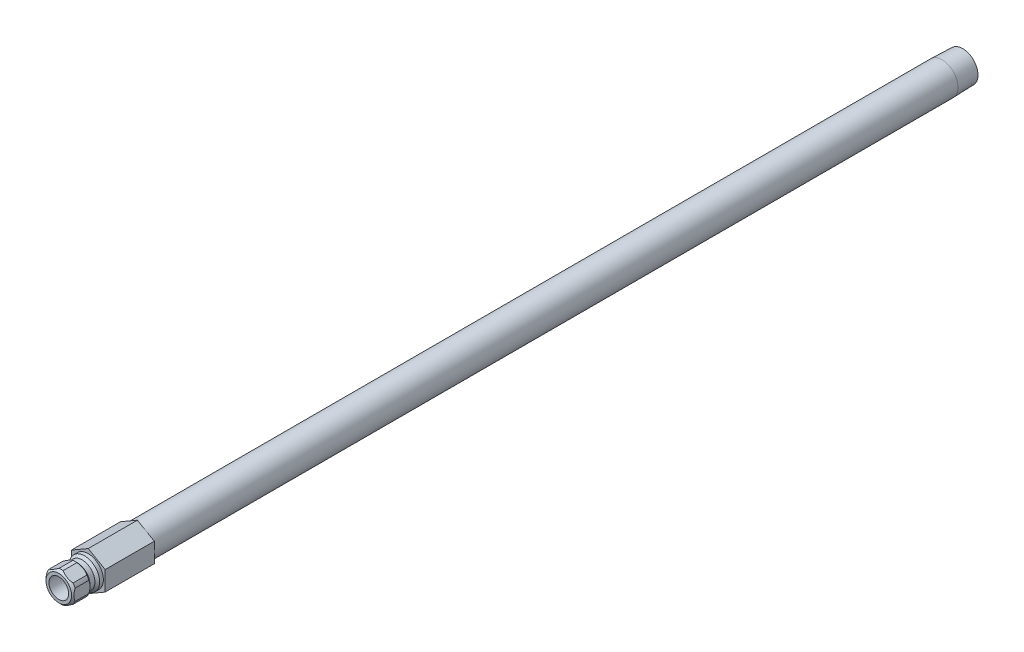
ISO-10303-21;
HEADER;
FILE_DESCRIPTION(('STEP AP214'),'2;1');
FILE_NAME('part.step','',(''),(''),'','','');
FILE_SCHEMA(('AUTOMOTIVE_DESIGN { 1 0 10303 214 1 1 1 1 }'));
ENDSEC;
DATA;
#1=APPLICATION_CONTEXT('core data for automotive mechanical design processes');
#2=APPLICATION_PROTOCOL_DEFINITION('international standard','automotive_design',2000,#1);
#3=PRODUCT_CONTEXT('',#1,'mechanical');
#4=PRODUCT('Part','Part','',(#3));
#5=PRODUCT_RELATED_PRODUCT_CATEGORY('part','',(#4));
#6=PRODUCT_DEFINITION_FORMATION('','',#4);
#7=PRODUCT_DEFINITION_CONTEXT('part definition',#1,'design');
#8=PRODUCT_DEFINITION('design','',#6,#7);
#9=PRODUCT_DEFINITION_SHAPE('','',#8);
#10=(LENGTH_UNIT() NAMED_UNIT(*) SI_UNIT(.MILLI.,.METRE.));
#11=(NAMED_UNIT(*) PLANE_ANGLE_UNIT() SI_UNIT($,.RADIAN.));
#12=(NAMED_UNIT(*) SI_UNIT($,.STERADIAN.) SOLID_ANGLE_UNIT());
#13=UNCERTAINTY_MEASURE_WITH_UNIT(LENGTH_MEASURE(1.E-05),#10,'distance_accuracy_value','');
#14=(GEOMETRIC_REPRESENTATION_CONTEXT(3) GLOBAL_UNCERTAINTY_ASSIGNED_CONTEXT((#13)) GLOBAL_UNIT_ASSIGNED_CONTEXT((#10,
#11,#12)) REPRESENTATION_CONTEXT('',''));
#15=CARTESIAN_POINT('',(0.,0.,0.));
#16=DIRECTION('',(0.,0.,1.));
#17=DIRECTION('',(1.,0.,0.));
#18=AXIS2_PLACEMENT_3D('',#15,#16,#17);
#19=CARTESIAN_POINT('',(0.,0.,0.));
#20=DIRECTION('',(0.,0.,-1.));
#21=DIRECTION('',(0.,1.,0.));
#22=AXIS2_PLACEMENT_3D('',#19,#20,#21);
#23=CYLINDRICAL_SURFACE('',#22,4.8895);
#24=DIRECTION('',(0.,0.,-1.));
#25=VECTOR('',#24,1.);
#26=CARTESIAN_POINT('',(-4.5212,-1.86170910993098,0.));
#27=LINE('',#26,#25);
#28=CARTESIAN_POINT('',(-4.5212,-1.86170910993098,4.318));
#29=VERTEX_POINT('',#28);
#30=CARTESIAN_POINT('',(-4.5212,-1.86170910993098,8.763));
#31=VERTEX_POINT('',#30);
#32=EDGE_CURVE('E61',#29,#31,#27,.F.);
#33=ORIENTED_EDGE('',*,*,#32,.F.);
#34=CARTESIAN_POINT('',(0.,0.,4.318));
#35=DIRECTION('',(0.,0.,-1.));
#36=DIRECTION('',(0.,1.,0.));
#37=AXIS2_PLACEMENT_3D('',#34,#35,#36);
#38=CIRCLE('',#37,4.8895);
#39=CARTESIAN_POINT('',(-3.87288738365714,-2.98461950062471,4.318));
#40=VERTEX_POINT('',#39);
#41=EDGE_CURVE('E650',#40,#29,#38,.T.);
#42=ORIENTED_EDGE('',*,*,#41,.F.);
#43=DIRECTION('',(0.,0.,-1.));
#44=VECTOR('',#43,1.);
#45=CARTESIAN_POINT('',(-3.87288738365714,-2.98461950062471,0.));
#46=LINE('',#45,#44);
#47=CARTESIAN_POINT('',(-3.87288738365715,-2.98461950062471,8.763));
#48=VERTEX_POINT('',#47);
#49=EDGE_CURVE('E218',#48,#40,#46,.T.);
#50=ORIENTED_EDGE('',*,*,#49,.F.);
#51=CARTESIAN_POINT('',(0.,0.,8.763));
#52=DIRECTION('',(0.,0.,-1.));
#53=DIRECTION('',(0.,1.,0.));
#54=AXIS2_PLACEMENT_3D('',#51,#52,#53);
#55=CIRCLE('',#54,4.8895);
#56=EDGE_CURVE('E189',#48,#31,#55,.T.);
#57=ORIENTED_EDGE('',*,*,#56,.T.);
#58=EDGE_LOOP('',(#33,#42,#50,#57));
#59=FACE_BOUND('',#58,.T.);
#60=ADVANCED_FACE('F34',(#59),#23,.T.);
#61=DIRECTION('',(0.,0.,-1.));
#62=VECTOR('',#61,1.);
#63=CARTESIAN_POINT('',(-0.648312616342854,-4.84632861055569,0.));
#64=LINE('',#63,#62);
#65=CARTESIAN_POINT('',(-0.648312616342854,-4.84632861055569,4.318));
#66=VERTEX_POINT('',#65);
#67=CARTESIAN_POINT('',(-0.648312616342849,-4.84632861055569,8.763));
#68=VERTEX_POINT('',#67);
#69=EDGE_CURVE('E232',#66,#68,#64,.F.);
#70=ORIENTED_EDGE('',*,*,#69,.F.);
#71=CARTESIAN_POINT('',(0.648312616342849,-4.84632861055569,4.318));
#72=VERTEX_POINT('',#71);
#73=EDGE_CURVE('E388',#72,#66,#38,.T.);
#74=ORIENTED_EDGE('',*,*,#73,.F.);
#75=DIRECTION('',(0.,0.,-1.));
#76=VECTOR('',#75,1.);
#77=CARTESIAN_POINT('',(0.648312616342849,-4.84632861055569,0.));
#78=LINE('',#77,#76);
#79=CARTESIAN_POINT('',(0.648312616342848,-4.84632861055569,8.763));
#80=VERTEX_POINT('',#79);
#81=EDGE_CURVE('E654',#80,#72,#78,.T.);
#82=ORIENTED_EDGE('',*,*,#81,.F.);
#83=EDGE_CURVE('E202',#80,#68,#55,.T.);
#84=ORIENTED_EDGE('',*,*,#83,.T.);
#85=EDGE_LOOP('',(#70,#74,#82,#84));
#86=FACE_BOUND('',#85,.T.);
#87=ADVANCED_FACE('F351',(#86),#23,.T.);
#88=DIRECTION('',(0.,0.,-1.));
#89=VECTOR('',#88,1.);
#90=CARTESIAN_POINT('',(3.87288738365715,-2.98461950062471,0.));
#91=LINE('',#90,#89);
#92=CARTESIAN_POINT('',(3.87288738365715,-2.98461950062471,4.318));
#93=VERTEX_POINT('',#92);
#94=CARTESIAN_POINT('',(3.87288738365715,-2.98461950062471,8.763));
#95=VERTEX_POINT('',#94);
#96=EDGE_CURVE('E294',#93,#95,#91,.F.);
#97=ORIENTED_EDGE('',*,*,#96,.F.);
#98=CARTESIAN_POINT('',(4.5212,-1.86170910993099,4.318));
#99=VERTEX_POINT('',#98);
#100=EDGE_CURVE('E384',#99,#93,#38,.T.);
#101=ORIENTED_EDGE('',*,*,#100,.F.);
#102=DIRECTION('',(0.,0.,-1.));
#103=VECTOR('',#102,1.);
#104=CARTESIAN_POINT('',(4.5212,-1.86170910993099,0.));
#105=LINE('',#104,#103);
#106=CARTESIAN_POINT('',(4.5212,-1.86170910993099,8.763));
#107=VERTEX_POINT('',#106);
#108=EDGE_CURVE('E377',#107,#99,#105,.T.);
#109=ORIENTED_EDGE('',*,*,#108,.F.);
#110=EDGE_CURVE('E195',#107,#95,#55,.T.);
#111=ORIENTED_EDGE('',*,*,#110,.T.);
#112=EDGE_LOOP('',(#97,#101,#109,#111));
#113=FACE_BOUND('',#112,.T.);
#114=ADVANCED_FACE('F355',(#113),#23,.T.);
#115=DIRECTION('',(0.,0.,-1.));
#116=VECTOR('',#115,1.);
#117=CARTESIAN_POINT('',(4.5212,1.86170910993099,0.));
#118=LINE('',#117,#116);
#119=CARTESIAN_POINT('',(4.5212,1.86170910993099,4.318));
#120=VERTEX_POINT('',#119);
#121=CARTESIAN_POINT('',(4.5212,1.86170910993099,8.763));
#122=VERTEX_POINT('',#121);
#123=EDGE_CURVE('E373',#120,#122,#118,.F.);
#124=ORIENTED_EDGE('',*,*,#123,.F.);
#125=CARTESIAN_POINT('',(3.87288738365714,2.98461950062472,4.318));
#126=VERTEX_POINT('',#125);
#127=EDGE_CURVE('E200',#126,#120,#38,.T.);
#128=ORIENTED_EDGE('',*,*,#127,.F.);
#129=DIRECTION('',(0.,0.,-1.));
#130=VECTOR('',#129,1.);
#131=CARTESIAN_POINT('',(3.87288738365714,2.98461950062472,0.));
#132=LINE('',#131,#130);
#133=CARTESIAN_POINT('',(3.87288738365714,2.98461950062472,8.763));
#134=VERTEX_POINT('',#133);
#135=EDGE_CURVE('E651',#134,#126,#132,.T.);
#136=ORIENTED_EDGE('',*,*,#135,.F.);
#137=EDGE_CURVE('E188',#134,#122,#55,.T.);
#138=ORIENTED_EDGE('',*,*,#137,.T.);
#139=EDGE_LOOP('',(#124,#128,#136,#138));
#140=FACE_BOUND('',#139,.T.);
#141=ADVANCED_FACE('F361',(#140),#23,.T.);
#142=DIRECTION('',(0.,0.,-1.));
#143=VECTOR('',#142,1.);
#144=CARTESIAN_POINT('',(0.648312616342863,4.84632861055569,0.));
#145=LINE('',#144,#143);
#146=CARTESIAN_POINT('',(0.648312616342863,4.84632861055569,4.318));
#147=VERTEX_POINT('',#146);
#148=CARTESIAN_POINT('',(0.648312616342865,4.84632861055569,8.763));
#149=VERTEX_POINT('',#148);
#150=EDGE_CURVE('E652',#147,#149,#145,.F.);
#151=ORIENTED_EDGE('',*,*,#150,.F.);
#152=CARTESIAN_POINT('',(-0.648312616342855,4.84632861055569,4.318));
#153=VERTEX_POINT('',#152);
#154=EDGE_CURVE('E179',#153,#147,#38,.T.);
#155=ORIENTED_EDGE('',*,*,#154,.F.);
#156=DIRECTION('',(0.,0.,-1.));
#157=VECTOR('',#156,1.);
#158=CARTESIAN_POINT('',(-0.648312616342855,4.84632861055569,0.));
#159=LINE('',#158,#157);
#160=CARTESIAN_POINT('',(-0.648312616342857,4.84632861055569,8.763));
#161=VERTEX_POINT('',#160);
#162=EDGE_CURVE('E163',#161,#153,#159,.T.);
#163=ORIENTED_EDGE('',*,*,#162,.F.);
#164=EDGE_CURVE('E177',#161,#149,#55,.T.);
#165=ORIENTED_EDGE('',*,*,#164,.T.);
#166=EDGE_LOOP('',(#151,#155,#163,#165));
#167=FACE_BOUND('',#166,.T.);
#168=ADVANCED_FACE('F176',(#167),#23,.T.);
#169=CARTESIAN_POINT('',(0.,4.8895,0.));
#170=DIRECTION('',(0.,0.,1.));
#171=DIRECTION('',(0.,-1.,0.));
#172=AXIS2_PLACEMENT_3D('',#169,#170,#171);
#173=PLANE('',#172);
#174=CARTESIAN_POINT('',(0.,0.,0.));
#175=DIRECTION('',(0.,0.,-1.));
#176=DIRECTION('',(0.,1.,0.));
#177=AXIS2_PLACEMENT_3D('',#174,#175,#176);
#178=CIRCLE('',#177,4.8895);
#179=CARTESIAN_POINT('',(0.,4.8895,0.));
#180=VERTEX_POINT('',#179);
#181=EDGE_CURVE('E395',#180,#180,#178,.T.);
#182=ORIENTED_EDGE('',*,*,#181,.T.);
#183=EDGE_LOOP('',(#182));
#184=FACE_BOUND('',#183,.T.);
#185=DIRECTION('',(-0.866025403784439,-0.5,0.));
#186=VECTOR('',#185,1.);
#187=CARTESIAN_POINT('',(0.,6.3058196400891,0.));
#188=LINE('',#187,#186);
#189=CARTESIAN_POINT('',(0.,6.3058196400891,0.));
#190=VERTEX_POINT('',#189);
#191=CARTESIAN_POINT('',(-5.461,3.15290982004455,0.));
#192=VERTEX_POINT('',#191);
#193=EDGE_CURVE('E445',#190,#192,#188,.T.);
#194=ORIENTED_EDGE('',*,*,#193,.T.);
#195=DIRECTION('',(0.,-1.,0.));
#196=VECTOR('',#195,1.);
#197=CARTESIAN_POINT('',(-5.461,3.15290982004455,0.));
#198=LINE('',#197,#196);
#199=CARTESIAN_POINT('',(-5.461,-3.15290982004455,0.));
#200=VERTEX_POINT('',#199);
#201=EDGE_CURVE('E448',#192,#200,#198,.T.);
#202=ORIENTED_EDGE('',*,*,#201,.T.);
#203=DIRECTION('',(0.866025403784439,-0.5,0.));
#204=VECTOR('',#203,1.);
#205=CARTESIAN_POINT('',(-5.461,-3.15290982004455,0.));
#206=LINE('',#205,#204);
#207=CARTESIAN_POINT('',(0.,-6.30581964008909,0.));
#208=VERTEX_POINT('',#207);
#209=EDGE_CURVE('E451',#200,#208,#206,.T.);
#210=ORIENTED_EDGE('',*,*,#209,.T.);
#211=DIRECTION('',(0.866025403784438,0.5,0.));
#212=VECTOR('',#211,1.);
#213=CARTESIAN_POINT('',(0.,-6.30581964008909,0.));
#214=LINE('',#213,#212);
#215=CARTESIAN_POINT('',(5.461,-3.15290982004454,0.));
#216=VERTEX_POINT('',#215);
#217=EDGE_CURVE('E454',#208,#216,#214,.T.);
#218=ORIENTED_EDGE('',*,*,#217,.T.);
#219=DIRECTION('',(0.,1.,0.));
#220=VECTOR('',#219,1.);
#221=CARTESIAN_POINT('',(5.461,-3.15290982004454,0.));
#222=LINE('',#221,#220);
#223=CARTESIAN_POINT('',(5.461,3.15290982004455,0.));
#224=VERTEX_POINT('',#223);
#225=EDGE_CURVE('E456',#216,#224,#222,.T.);
#226=ORIENTED_EDGE('',*,*,#225,.T.);
#227=DIRECTION('',(-0.866025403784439,0.5,0.));
#228=VECTOR('',#227,1.);
#229=CARTESIAN_POINT('',(5.461,3.15290982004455,0.));
#230=LINE('',#229,#228);
#231=EDGE_CURVE('E424',#224,#190,#230,.T.);
#232=ORIENTED_EDGE('',*,*,#231,.T.);
#233=EDGE_LOOP('',(#194,#202,#210,#218,#226,#232));
#234=FACE_BOUND('',#233,.T.);
#235=ADVANCED_FACE('F360',(#184,#234),#173,.T.);
#236=CARTESIAN_POINT('',(0.,0.,0.));
#237=DIRECTION('',(0.,0.,-1.));
#238=DIRECTION('',(0.,1.,0.));
#239=AXIS2_PLACEMENT_3D('',#236,#237,#238);
#240=CYLINDRICAL_SURFACE('',#239,4.8895);
#241=CARTESIAN_POINT('',(0.,0.,1.2065));
#242=DIRECTION('',(0.,0.,-1.));
#243=DIRECTION('',(0.,1.,0.));
#244=AXIS2_PLACEMENT_3D('',#241,#242,#243);
#245=CIRCLE('',#244,4.8895);
#246=CARTESIAN_POINT('',(0.,4.8895,1.2065));
#247=VERTEX_POINT('',#246);
#248=EDGE_CURVE('E392',#247,#247,#245,.T.);
#249=ORIENTED_EDGE('',*,*,#248,.T.);
#250=EDGE_LOOP('',(#249));
#251=FACE_BOUND('',#250,.T.);
#252=ORIENTED_EDGE('',*,*,#181,.F.);
#253=EDGE_LOOP('',(#252));
#254=FACE_BOUND('',#253,.T.);
#255=ADVANCED_FACE('F366',(#251,#254),#240,.T.);
#256=CARTESIAN_POINT('',(0.,0.,1.2065));
#257=DIRECTION('',(0.,0.,-1.));
#258=DIRECTION('',(0.,1.,0.));
#259=AXIS2_PLACEMENT_3D('',#256,#257,#258);
#260=CONICAL_SURFACE('',#259,4.8895,0.785398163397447);
#261=CARTESIAN_POINT('',(0.,0.,1.9685));
#262=DIRECTION('',(0.,0.,-1.));
#263=DIRECTION('',(0.,1.,0.));
#264=AXIS2_PLACEMENT_3D('',#261,#262,#263);
#265=CIRCLE('',#264,4.1275);
#266=CARTESIAN_POINT('',(0.,4.1275,1.9685));
#267=VERTEX_POINT('',#266);
#268=EDGE_CURVE('E386',#267,#267,#265,.T.);
#269=ORIENTED_EDGE('',*,*,#268,.T.);
#270=EDGE_LOOP('',(#269));
#271=FACE_BOUND('',#270,.T.);
#272=ORIENTED_EDGE('',*,*,#248,.F.);
#273=EDGE_LOOP('',(#272));
#274=FACE_BOUND('',#273,.T.);
#275=ADVANCED_FACE('F704',(#271,#274),#260,.T.);
#276=CARTESIAN_POINT('',(0.,0.,0.));
#277=DIRECTION('',(0.,0.,-1.));
#278=DIRECTION('',(0.,1.,0.));
#279=AXIS2_PLACEMENT_3D('',#276,#277,#278);
#280=CYLINDRICAL_SURFACE('',#279,4.1275);
#281=CARTESIAN_POINT('',(0.,0.,3.556));
#282=DIRECTION('',(0.,0.,-1.));
#283=DIRECTION('',(0.,1.,0.));
#284=AXIS2_PLACEMENT_3D('',#281,#282,#283);
#285=CIRCLE('',#284,4.1275);
#286=CARTESIAN_POINT('',(0.,4.1275,3.556));
#287=VERTEX_POINT('',#286);
#288=EDGE_CURVE('E383',#287,#287,#285,.T.);
#289=ORIENTED_EDGE('',*,*,#288,.T.);
#290=EDGE_LOOP('',(#289));
#291=FACE_BOUND('',#290,.T.);
#292=ORIENTED_EDGE('',*,*,#268,.F.);
#293=EDGE_LOOP('',(#292));
#294=FACE_BOUND('',#293,.T.);
#295=ADVANCED_FACE('F254',(#291,#294),#280,.T.);
#296=CARTESIAN_POINT('',(0.,0.,3.556));
#297=DIRECTION('',(0.,0.,1.));
#298=DIRECTION('',(0.,-1.,0.));
#299=AXIS2_PLACEMENT_3D('',#296,#297,#298);
#300=CONICAL_SURFACE('',#299,4.1275,0.785398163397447);
#301=CARTESIAN_POINT('',(-4.5212,-5.15925306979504,6.2884665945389));
#302=CARTESIAN_POINT('',(-4.5212,-5.03341781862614,6.19384981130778));
#303=CARTESIAN_POINT('',(-4.5212,-4.90687282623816,6.10016148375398));
#304=CARTESIAN_POINT('',(-4.5212,-4.65208542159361,5.91505573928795));
#305=CARTESIAN_POINT('',(-4.5212,-4.52384258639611,5.82363890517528));
#306=CARTESIAN_POINT('',(-4.5212,-4.26444371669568,5.64284060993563));
#307=CARTESIAN_POINT('',(-4.5212,-4.13327280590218,5.55348041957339));
#308=CARTESIAN_POINT('',(-4.5212,-3.86869655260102,5.37814219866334));
#309=CARTESIAN_POINT('',(-4.5212,-3.735291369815,5.29216392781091));
#310=CARTESIAN_POINT('',(-4.5212,-3.45835736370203,5.1196421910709));
#311=CARTESIAN_POINT('',(-4.5212,-3.31467977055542,5.03333631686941));
#312=CARTESIAN_POINT('',(-4.5212,-3.02397608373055,4.86646929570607));
#313=CARTESIAN_POINT('',(-4.5212,-2.87694947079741,4.78590904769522));
#314=CARTESIAN_POINT('',(-4.5212,-2.57957206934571,4.6322757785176));
#315=CARTESIAN_POINT('',(-4.5212,-2.42923274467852,4.55918074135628));
#316=CARTESIAN_POINT('',(-4.5212,-2.12448469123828,4.42211381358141));
#317=CARTESIAN_POINT('',(-4.5212,-1.97007782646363,4.35813782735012));
#318=CARTESIAN_POINT('',(-4.5212,-1.66898205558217,4.24604782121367));
#319=CARTESIAN_POINT('',(-4.5212,-1.52260919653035,4.19709368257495));
#320=CARTESIAN_POINT('',(-4.5212,-1.22638031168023,4.11093488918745));
#321=CARTESIAN_POINT('',(-4.5212,-1.07652404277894,4.07373105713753));
#322=CARTESIAN_POINT('',(-4.5212,-0.776693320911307,4.01362130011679));
#323=CARTESIAN_POINT('',(-4.5212,-0.626768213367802,3.99047322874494));
#324=CARTESIAN_POINT('',(-4.5212,-0.325366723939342,3.95891692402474));
#325=CARTESIAN_POINT('',(-4.5212,-0.173890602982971,3.95050625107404));
#326=CARTESIAN_POINT('',(-4.5212,0.123852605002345,3.94903068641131));
#327=CARTESIAN_POINT('',(-4.5212,0.270117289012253,3.95544130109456));
#328=CARTESIAN_POINT('',(-4.5212,0.561370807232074,3.98210770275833));
#329=CARTESIAN_POINT('',(-4.5212,0.706359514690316,4.0023648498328));
#330=CARTESIAN_POINT('',(-4.5212,0.996462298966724,4.05597163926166));
#331=CARTESIAN_POINT('',(-4.5212,1.14153485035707,4.08954247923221));
#332=CARTESIAN_POINT('',(-4.5212,1.42852462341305,4.16800024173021));
#333=CARTESIAN_POINT('',(-4.5212,1.5704421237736,4.21288616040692));
#334=CARTESIAN_POINT('',(-4.5212,1.86505501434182,4.3171412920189));
#335=CARTESIAN_POINT('',(-4.5212,2.01739126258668,4.37751543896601));
#336=CARTESIAN_POINT('',(-4.5212,2.31809735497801,4.5075182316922));
#337=CARTESIAN_POINT('',(-4.5212,2.46646529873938,4.57715121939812));
#338=CARTESIAN_POINT('',(-4.5212,2.75996557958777,4.72401353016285));
#339=CARTESIAN_POINT('',(-4.5212,2.90508583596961,4.80126680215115));
#340=CARTESIAN_POINT('',(-4.5212,3.19198335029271,4.96166050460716));
#341=CARTESIAN_POINT('',(-4.5212,3.33376113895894,5.04479999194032));
#342=CARTESIAN_POINT('',(-4.5212,3.60742153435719,5.21154136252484));
#343=CARTESIAN_POINT('',(-4.5212,3.73944496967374,5.29491333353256));
#344=CARTESIAN_POINT('',(-4.5212,4.00122581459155,5.4651527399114));
#345=CARTESIAN_POINT('',(-4.5212,4.13098305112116,5.55202044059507));
#346=CARTESIAN_POINT('',(-4.5212,4.387473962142,5.72790624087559));
#347=CARTESIAN_POINT('',(-4.5212,4.51422365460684,5.81690106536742));
#348=CARTESIAN_POINT('',(-4.5212,4.76599253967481,5.99723636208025));
#349=CARTESIAN_POINT('',(-4.5212,4.8910121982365,6.08857618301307));
#350=CARTESIAN_POINT('',(-4.5212,5.01530771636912,6.18087446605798));
#351=B_SPLINE_CURVE_WITH_KNOTS('',3,(#301,#302,#303,#304,#305,#306,#307,#308,#309,#310,#311,
#312,#313,#314,#315,#316,#317,#318,#319,#320,#321,#322,#323,#324,#325,#326,#327,#328,#329,#330,
#331,#332,#333,#334,#335,#336,#337,#338,#339,#340,#341,#342,#343,#344,#345,#346,#347,#348,#349,
#350),.UNSPECIFIED.,.F.,.F.,(4,2,2,2,2,2,2,2,2,2,2,2,2,2,2,2,2,2,2,2,2,2,2,2,4),(0.,
0.472324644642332,0.944769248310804,1.42087610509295,1.89694907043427,2.39966187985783,
2.90245317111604,3.40371602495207,3.90475303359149,4.3673713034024,4.83002195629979,
5.28445770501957,5.73881822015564,6.1773471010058,6.615919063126,7.06210522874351,
7.50825182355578,7.9994594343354,8.49089821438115,8.98393391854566,9.47689080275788,
9.94525924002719,10.4136632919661,10.8782525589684,11.3427141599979),.UNSPECIFIED.);
#352=CARTESIAN_POINT('',(-4.5212,1.86170910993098,4.318));
#353=VERTEX_POINT('',#352);
#354=EDGE_CURVE('E230',#353,#29,#351,.F.);
#355=ORIENTED_EDGE('',*,*,#354,.F.);
#356=CARTESIAN_POINT('',(-3.87288738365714,2.98461950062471,4.318));
#357=VERTEX_POINT('',#356);
#358=EDGE_CURVE('E199',#353,#357,#38,.T.);
#359=ORIENTED_EDGE('',*,*,#358,.T.);
#360=CARTESIAN_POINT('',(-0.647857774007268,4.84659121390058,4.3182));
#361=CARTESIAN_POINT('',(-0.775261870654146,4.77303442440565,4.26213711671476));
#362=CARTESIAN_POINT('',(-0.904457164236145,4.69844348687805,4.21102627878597));
#363=CARTESIAN_POINT('',(-1.16629518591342,4.5472712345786,4.12074318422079));
#364=CARTESIAN_POINT('',(-1.29894624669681,4.47068510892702,4.08160338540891));
#365=CARTESIAN_POINT('',(-1.56203676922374,4.31878972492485,4.01877592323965));
#366=CARTESIAN_POINT('',(-1.69238331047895,4.24353411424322,3.99458163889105));
#367=CARTESIAN_POINT('',(-1.95434729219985,4.09228913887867,3.96102228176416));
#368=CARTESIAN_POINT('',(-2.0859628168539,4.01630088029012,3.95163757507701));
#369=CARTESIAN_POINT('',(-2.35623055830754,3.86026172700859,3.9482192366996));
#370=CARTESIAN_POINT('',(-2.49489129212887,3.78020591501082,3.95501290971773));
#371=CARTESIAN_POINT('',(-2.7710334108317,3.62077518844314,3.98518499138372));
#372=CARTESIAN_POINT('',(-2.90851272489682,3.54140146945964,4.00858815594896));
#373=CARTESIAN_POINT('',(-3.18622016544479,3.38106700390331,4.07155129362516));
#374=CARTESIAN_POINT('',(-3.32634361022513,3.3001666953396,4.11171074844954));
#375=CARTESIAN_POINT('',(-3.60275664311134,3.14057955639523,4.20550294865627));
#376=CARTESIAN_POINT('',(-3.73905611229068,3.06188702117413,4.2590965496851));
#377=CARTESIAN_POINT('',(-3.87334222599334,2.98435689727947,4.31820000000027));
#378=B_SPLINE_CURVE_WITH_KNOTS('',3,(#360,#361,#362,#363,#364,#365,#366,#367,#368,#369,#370,
#371,#372,#373,#374,#375,#376,#377),.UNSPECIFIED.,.F.,.F.,(4,2,2,2,2,2,2,2,4),(0.,
0.472469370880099,0.946208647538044,1.40285320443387,1.85889185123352,2.33874707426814,
2.81931901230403,3.31879975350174,3.81684169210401),.UNSPECIFIED.);
#379=EDGE_CURVE('E260',#153,#357,#378,.T.);
#380=ORIENTED_EDGE('',*,*,#379,.F.);
#381=ORIENTED_EDGE('',*,*,#154,.T.);
#382=CARTESIAN_POINT('',(3.87334222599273,2.98435689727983,4.3182));
#383=CARTESIAN_POINT('',(3.74593812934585,3.05791368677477,4.26213711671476));
#384=CARTESIAN_POINT('',(3.61674283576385,3.13250462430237,4.21102627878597));
#385=CARTESIAN_POINT('',(3.35490481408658,3.28367687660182,4.12074318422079));
#386=CARTESIAN_POINT('',(3.22225375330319,3.3602630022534,4.08160338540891));
#387=CARTESIAN_POINT('',(2.95916323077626,3.51215838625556,4.01877592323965));
#388=CARTESIAN_POINT('',(2.82881668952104,3.5874139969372,3.99458163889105));
#389=CARTESIAN_POINT('',(2.56685270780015,3.73865897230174,3.96102228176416));
#390=CARTESIAN_POINT('',(2.4352371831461,3.81464723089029,3.95163757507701));
#391=CARTESIAN_POINT('',(2.16496944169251,3.97068638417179,3.94821923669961));
#392=CARTESIAN_POINT('',(2.02630870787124,4.05074219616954,3.95501290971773));
#393=CARTESIAN_POINT('',(1.75016658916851,4.21017292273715,3.98518499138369));
#394=CARTESIAN_POINT('',(1.61268727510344,4.28954664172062,4.00858815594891));
#395=CARTESIAN_POINT('',(1.33497983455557,4.44988110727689,4.07155129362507));
#396=CARTESIAN_POINT('',(1.19485638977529,4.53078141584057,4.11171074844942));
#397=CARTESIAN_POINT('',(0.918443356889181,4.69036855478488,4.20550294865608));
#398=CARTESIAN_POINT('',(0.782143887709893,4.76906109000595,4.25909654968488));
#399=CARTESIAN_POINT('',(0.647857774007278,4.84659121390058,4.3182));
#400=B_SPLINE_CURVE_WITH_KNOTS('',3,(#382,#383,#384,#385,#386,#387,#388,#389,#390,#391,#392,
#393,#394,#395,#396,#397,#398,#399),.UNSPECIFIED.,.F.,.F.,(4,2,2,2,2,2,2,2,4),(0.,
0.472469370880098,0.946208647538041,1.40285320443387,1.85889185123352,2.33874707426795,
2.81931901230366,3.31879975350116,3.81684169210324),.UNSPECIFIED.);
#401=EDGE_CURVE('E270',#126,#147,#400,.T.);
#402=ORIENTED_EDGE('',*,*,#401,.F.);
#403=ORIENTED_EDGE('',*,*,#127,.T.);
#404=CARTESIAN_POINT('',(4.5212,-5.15925306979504,6.2884665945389));
#405=CARTESIAN_POINT('',(4.5212,-5.03341781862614,6.19384981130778));
#406=CARTESIAN_POINT('',(4.5212,-4.90687282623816,6.10016148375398));
#407=CARTESIAN_POINT('',(4.5212,-4.65208542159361,5.91505573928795));
#408=CARTESIAN_POINT('',(4.5212,-4.52384258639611,5.82363890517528));
#409=CARTESIAN_POINT('',(4.5212,-4.26444371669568,5.64284060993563));
#410=CARTESIAN_POINT('',(4.5212,-4.13327280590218,5.55348041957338));
#411=CARTESIAN_POINT('',(4.5212,-3.86869655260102,5.37814219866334));
#412=CARTESIAN_POINT('',(4.5212,-3.735291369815,5.2921639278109));
#413=CARTESIAN_POINT('',(4.5212,-3.45835736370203,5.1196421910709));
#414=CARTESIAN_POINT('',(4.5212,-3.31467977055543,5.03333631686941));
#415=CARTESIAN_POINT('',(4.5212,-3.02397608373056,4.86646929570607));
#416=CARTESIAN_POINT('',(4.5212,-2.87694947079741,4.78590904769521));
#417=CARTESIAN_POINT('',(4.5212,-2.57957206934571,4.63227577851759));
#418=CARTESIAN_POINT('',(4.5212,-2.42923274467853,4.55918074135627));
#419=CARTESIAN_POINT('',(4.5212,-2.12448469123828,4.4221138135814));
#420=CARTESIAN_POINT('',(4.5212,-1.97007782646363,4.35813782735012));
#421=CARTESIAN_POINT('',(4.5212,-1.66898205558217,4.24604782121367));
#422=CARTESIAN_POINT('',(4.5212,-1.52260919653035,4.19709368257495));
#423=CARTESIAN_POINT('',(4.5212,-1.22638031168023,4.11093488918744));
#424=CARTESIAN_POINT('',(4.5212,-1.07652404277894,4.07373105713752));
#425=CARTESIAN_POINT('',(4.5212,-0.776693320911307,4.01362130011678));
#426=CARTESIAN_POINT('',(4.5212,-0.626768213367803,3.99047322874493));
#427=CARTESIAN_POINT('',(4.5212,-0.325366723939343,3.95891692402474));
#428=CARTESIAN_POINT('',(4.5212,-0.173890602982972,3.95050625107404));
#429=CARTESIAN_POINT('',(4.5212,0.123852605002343,3.94903068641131));
#430=CARTESIAN_POINT('',(4.5212,0.27011728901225,3.95544130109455));
#431=CARTESIAN_POINT('',(4.5212,0.561370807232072,3.98210770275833));
#432=CARTESIAN_POINT('',(4.5212,0.706359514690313,4.0023648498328));
#433=CARTESIAN_POINT('',(4.5212,0.99646229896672,4.05597163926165));
#434=CARTESIAN_POINT('',(4.5212,1.14153485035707,4.08954247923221));
#435=CARTESIAN_POINT('',(4.5212,1.42852462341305,4.16800024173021));
#436=CARTESIAN_POINT('',(4.5212,1.5704421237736,4.21288616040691));
#437=CARTESIAN_POINT('',(4.5212,1.86505501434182,4.3171412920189));
#438=CARTESIAN_POINT('',(4.5212,2.01739126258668,4.377515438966));
#439=CARTESIAN_POINT('',(4.5212,2.318097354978,4.50751823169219));
#440=CARTESIAN_POINT('',(4.5212,2.46646529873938,4.57715121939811));
#441=CARTESIAN_POINT('',(4.5212,2.75996557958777,4.72401353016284));
#442=CARTESIAN_POINT('',(4.5212,2.9050858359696,4.80126680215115));
#443=CARTESIAN_POINT('',(4.5212,3.1919833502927,4.96166050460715));
#444=CARTESIAN_POINT('',(4.5212,3.33376113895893,5.04479999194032));
#445=CARTESIAN_POINT('',(4.5212,3.60742153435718,5.21154136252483));
#446=CARTESIAN_POINT('',(4.5212,3.73944496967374,5.29491333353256));
#447=CARTESIAN_POINT('',(4.5212,4.00122581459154,5.46515273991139));
#448=CARTESIAN_POINT('',(4.5212,4.13098305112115,5.55202044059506));
#449=CARTESIAN_POINT('',(4.5212,4.38747396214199,5.72790624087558));
#450=CARTESIAN_POINT('',(4.5212,4.51422365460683,5.81690106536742));
#451=CARTESIAN_POINT('',(4.5212,4.76599253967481,5.99723636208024));
#452=CARTESIAN_POINT('',(4.5212,4.89101219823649,6.08857618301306));
#453=CARTESIAN_POINT('',(4.5212,5.01530771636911,6.18087446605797));
#454=B_SPLINE_CURVE_WITH_KNOTS('',3,(#404,#405,#406,#407,#408,#409,#410,#411,#412,#413,#414,
#415,#416,#417,#418,#419,#420,#421,#422,#423,#424,#425,#426,#427,#428,#429,#430,#431,#432,#433,
#434,#435,#436,#437,#438,#439,#440,#441,#442,#443,#444,#445,#446,#447,#448,#449,#450,#451,#452,
#453),.UNSPECIFIED.,.F.,.F.,(4,2,2,2,2,2,2,2,2,2,2,2,2,2,2,2,2,2,2,2,2,2,2,2,4),(0.,
0.472324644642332,0.944769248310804,1.42087610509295,1.89694907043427,2.39966187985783,
2.90245317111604,3.40371602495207,3.90475303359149,4.3673713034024,4.83002195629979,
5.28445770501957,5.73881822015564,6.1773471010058,6.615919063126,7.06210522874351,
7.50825182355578,7.9994594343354,8.49089821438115,8.98393391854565,9.47689080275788,
9.94525924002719,10.4136632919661,10.8782525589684,11.3427141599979),.UNSPECIFIED.);
#455=EDGE_CURVE('E279',#99,#120,#454,.T.);
#456=ORIENTED_EDGE('',*,*,#455,.F.);
#457=ORIENTED_EDGE('',*,*,#100,.T.);
#458=CARTESIAN_POINT('',(0.647857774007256,-4.84659121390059,4.3182));
#459=CARTESIAN_POINT('',(0.775261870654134,-4.77303442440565,4.26213711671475));
#460=CARTESIAN_POINT('',(0.904457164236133,-4.69844348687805,4.21102627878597));
#461=CARTESIAN_POINT('',(1.16629518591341,-4.5472712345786,4.12074318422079));
#462=CARTESIAN_POINT('',(1.2989462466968,-4.47068510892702,4.08160338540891));
#463=CARTESIAN_POINT('',(1.56203676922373,-4.31878972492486,4.01877592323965));
#464=CARTESIAN_POINT('',(1.69238331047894,-4.24353411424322,3.99458163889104));
#465=CARTESIAN_POINT('',(1.95434729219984,-4.09228913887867,3.96102228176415));
#466=CARTESIAN_POINT('',(2.08596281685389,-4.01630088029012,3.951637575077));
#467=CARTESIAN_POINT('',(2.35623055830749,-3.86026172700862,3.9482192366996));
#468=CARTESIAN_POINT('',(2.49489129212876,-3.78020591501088,3.95501290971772));
#469=CARTESIAN_POINT('',(2.77103341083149,-3.62077518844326,3.98518499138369));
#470=CARTESIAN_POINT('',(2.90851272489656,-3.54140146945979,4.0085881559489));
#471=CARTESIAN_POINT('',(3.18622016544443,-3.38106700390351,4.07155129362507));
#472=CARTESIAN_POINT('',(3.32634361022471,-3.30016669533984,4.11171074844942));
#473=CARTESIAN_POINT('',(3.60275664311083,-3.14057955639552,4.20550294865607));
#474=CARTESIAN_POINT('',(3.73905611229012,-3.06188702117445,4.25909654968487));
#475=CARTESIAN_POINT('',(3.87334222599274,-2.98435689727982,4.3182));
#476=B_SPLINE_CURVE_WITH_KNOTS('',3,(#458,#459,#460,#461,#462,#463,#464,#465,#466,#467,#468,
#469,#470,#471,#472,#473,#474,#475),.UNSPECIFIED.,.F.,.F.,(4,2,2,2,2,2,2,2,4),(0.,
0.4724693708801,0.946208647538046,1.40285320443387,1.85889185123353,2.33874707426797,
2.81931901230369,3.3187997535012,3.81684169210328),.UNSPECIFIED.);
#477=EDGE_CURVE('E287',#72,#93,#476,.T.);
#478=ORIENTED_EDGE('',*,*,#477,.F.);
#479=ORIENTED_EDGE('',*,*,#73,.T.);
#480=CARTESIAN_POINT('',(-3.87334222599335,-2.98435689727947,4.31820000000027));
#481=CARTESIAN_POINT('',(-3.74593812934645,-3.05791368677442,4.262137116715));
#482=CARTESIAN_POINT('',(-3.61674283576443,-3.13250462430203,4.21102627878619));
#483=CARTESIAN_POINT('',(-3.35490481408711,-3.28367687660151,4.12074318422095));
#484=CARTESIAN_POINT('',(-3.2222537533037,-3.3602630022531,4.08160338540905));
#485=CARTESIAN_POINT('',(-2.95916323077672,-3.51215838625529,4.01877592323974));
#486=CARTESIAN_POINT('',(-2.82881668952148,-3.58741399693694,3.99458163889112));
#487=CARTESIAN_POINT('',(-2.56685270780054,-3.73865897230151,3.96102228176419));
#488=CARTESIAN_POINT('',(-2.43523718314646,-3.81464723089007,3.95163757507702));
#489=CARTESIAN_POINT('',(-2.16496944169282,-3.97068638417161,3.94821923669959));
#490=CARTESIAN_POINT('',(-2.02630870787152,-4.05074219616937,3.95501290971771));
#491=CARTESIAN_POINT('',(-1.75016658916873,-4.21017292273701,3.98518499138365));
#492=CARTESIAN_POINT('',(-1.61268727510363,-4.2895466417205,4.00858815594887));
#493=CARTESIAN_POINT('',(-1.33497983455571,-4.44988110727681,4.07155129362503));
#494=CARTESIAN_POINT('',(-1.1948563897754,-4.5307814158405,4.11171074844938));
#495=CARTESIAN_POINT('',(-0.918443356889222,-4.69036855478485,4.20550294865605));
#496=CARTESIAN_POINT('',(-0.782143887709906,-4.76906109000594,4.25909654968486));
#497=CARTESIAN_POINT('',(-0.647857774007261,-4.84659121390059,4.3182));
#498=B_SPLINE_CURVE_WITH_KNOTS('',3,(#480,#481,#482,#483,#484,#485,#486,#487,#488,#489,#490,
#491,#492,#493,#494,#495,#496,#497),.UNSPECIFIED.,.F.,.F.,(4,2,2,2,2,2,2,2,4),(0.,
0.472469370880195,0.946208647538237,1.40285320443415,1.85889185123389,2.33874707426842,
2.81931901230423,3.31879975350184,3.81684169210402),.UNSPECIFIED.);
#499=EDGE_CURVE('E228',#40,#66,#498,.T.);
#500=ORIENTED_EDGE('',*,*,#499,.F.);
#501=ORIENTED_EDGE('',*,*,#41,.T.);
#502=EDGE_LOOP('',(#355,#359,#380,#381,#402,#403,#456,#457,#478,#479,#500,#501));
#503=FACE_BOUND('',#502,.T.);
#504=ORIENTED_EDGE('',*,*,#288,.F.);
#505=EDGE_LOOP('',(#504));
#506=FACE_BOUND('',#505,.T.);
#507=ADVANCED_FACE('F249',(#503,#506),#300,.T.);
#508=DIRECTION('',(0.,0.,-1.));
#509=VECTOR('',#508,1.);
#510=CARTESIAN_POINT('',(-4.5212,1.86170910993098,0.));
#511=LINE('',#510,#509);
#512=CARTESIAN_POINT('',(-4.5212,1.86170910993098,8.763));
#513=VERTEX_POINT('',#512);
#514=EDGE_CURVE('E222',#513,#353,#511,.T.);
#515=ORIENTED_EDGE('',*,*,#514,.F.);
#516=CARTESIAN_POINT('',(-3.87288738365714,2.98461950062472,8.763));
#517=VERTEX_POINT('',#516);
#518=EDGE_CURVE('E185',#513,#517,#55,.T.);
#519=ORIENTED_EDGE('',*,*,#518,.T.);
#520=DIRECTION('',(0.,0.,-1.));
#521=VECTOR('',#520,1.);
#522=CARTESIAN_POINT('',(-3.87288738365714,2.98461950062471,0.));
#523=LINE('',#522,#521);
#524=EDGE_CURVE('E54',#357,#517,#523,.F.);
#525=ORIENTED_EDGE('',*,*,#524,.F.);
#526=ORIENTED_EDGE('',*,*,#358,.F.);
#527=EDGE_LOOP('',(#515,#519,#525,#526));
#528=FACE_BOUND('',#527,.T.);
#529=ADVANCED_FACE('F226',(#528),#23,.T.);
#530=CARTESIAN_POINT('',(0.,0.,8.763));
#531=DIRECTION('',(0.,0.,-1.));
#532=DIRECTION('',(0.,1.,0.));
#533=AXIS2_PLACEMENT_3D('',#530,#531,#532);
#534=CONICAL_SURFACE('',#533,4.8895,0.785398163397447);
#535=CARTESIAN_POINT('',(-4.5212,-5.15925306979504,6.7925334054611));
#536=CARTESIAN_POINT('',(-4.5212,-5.03341781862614,6.88715018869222));
#537=CARTESIAN_POINT('',(-4.5212,-4.90687282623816,6.98083851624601));
#538=CARTESIAN_POINT('',(-4.5212,-4.65208542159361,7.16594426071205));
#539=CARTESIAN_POINT('',(-4.5212,-4.52384258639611,7.25736109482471));
#540=CARTESIAN_POINT('',(-4.5212,-4.26444371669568,7.43815939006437));
#541=CARTESIAN_POINT('',(-4.5212,-4.13327280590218,7.52751958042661));
#542=CARTESIAN_POINT('',(-4.5212,-3.86869655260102,7.70285780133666));
#543=CARTESIAN_POINT('',(-4.5212,-3.73529136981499,7.7888360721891));
#544=CARTESIAN_POINT('',(-4.5212,-3.45835736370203,7.9613578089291));
#545=CARTESIAN_POINT('',(-4.5212,-3.31467977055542,8.04766368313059));
#546=CARTESIAN_POINT('',(-4.5212,-3.02397608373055,8.21453070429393));
#547=CARTESIAN_POINT('',(-4.5212,-2.87694947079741,8.29509095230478));
#548=CARTESIAN_POINT('',(-4.5212,-2.57957206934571,8.4487242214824));
#549=CARTESIAN_POINT('',(-4.5212,-2.42923274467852,8.52181925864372));
#550=CARTESIAN_POINT('',(-4.5212,-2.12448469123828,8.6588861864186));
#551=CARTESIAN_POINT('',(-4.5212,-1.97007782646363,8.72286217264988));
#552=CARTESIAN_POINT('',(-4.5212,-1.66898205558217,8.83495217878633));
#553=CARTESIAN_POINT('',(-4.5212,-1.52260919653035,8.88390631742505));
#554=CARTESIAN_POINT('',(-4.5212,-1.22638031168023,8.97006511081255));
#555=CARTESIAN_POINT('',(-4.5212,-1.07652404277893,9.00726894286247));
#556=CARTESIAN_POINT('',(-4.5212,-0.776693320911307,9.06737869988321));
#557=CARTESIAN_POINT('',(-4.5212,-0.626768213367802,9.09052677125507));
#558=CARTESIAN_POINT('',(-4.5212,-0.325366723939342,9.12208307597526));
#559=CARTESIAN_POINT('',(-4.5212,-0.173890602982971,9.13049374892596));
#560=CARTESIAN_POINT('',(-4.5212,0.123852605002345,9.13196931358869));
#561=CARTESIAN_POINT('',(-4.5212,0.270117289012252,9.12555869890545));
#562=CARTESIAN_POINT('',(-4.5212,0.561370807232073,9.09889229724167));
#563=CARTESIAN_POINT('',(-4.5212,0.706359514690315,9.0786351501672));
#564=CARTESIAN_POINT('',(-4.5212,0.996462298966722,9.02502836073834));
#565=CARTESIAN_POINT('',(-4.5212,1.14153485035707,8.99145752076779));
#566=CARTESIAN_POINT('',(-4.5212,1.42852462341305,8.91299975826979));
#567=CARTESIAN_POINT('',(-4.5212,1.5704421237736,8.86811383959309));
#568=CARTESIAN_POINT('',(-4.5212,1.86505501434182,8.7638587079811));
#569=CARTESIAN_POINT('',(-4.5212,2.01739126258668,8.70348456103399));
#570=CARTESIAN_POINT('',(-4.5212,2.318097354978,8.5734817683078));
#571=CARTESIAN_POINT('',(-4.5212,2.46646529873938,8.50384878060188));
#572=CARTESIAN_POINT('',(-4.5212,2.75996557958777,8.35698646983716));
#573=CARTESIAN_POINT('',(-4.5212,2.90508583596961,8.27973319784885));
#574=CARTESIAN_POINT('',(-4.5212,3.1919833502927,8.11933949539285));
#575=CARTESIAN_POINT('',(-4.5212,3.33376113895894,8.03620000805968));
#576=CARTESIAN_POINT('',(-4.5212,3.60742153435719,7.86945863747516));
#577=CARTESIAN_POINT('',(-4.5212,3.73944496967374,7.78608666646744));
#578=CARTESIAN_POINT('',(-4.5212,4.00122581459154,7.6158472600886));
#579=CARTESIAN_POINT('',(-4.5212,4.13098305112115,7.52897955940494));
#580=CARTESIAN_POINT('',(-4.5212,4.38747396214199,7.35309375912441));
#581=CARTESIAN_POINT('',(-4.5212,4.51422365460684,7.26409893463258));
#582=CARTESIAN_POINT('',(-4.5212,4.76599253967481,7.08376363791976));
#583=CARTESIAN_POINT('',(-4.5212,4.8910121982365,6.99242381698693));
#584=CARTESIAN_POINT('',(-4.5212,5.01530771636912,6.90012553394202));
#585=B_SPLINE_CURVE_WITH_KNOTS('',3,(#535,#536,#537,#538,#539,#540,#541,#542,#543,#544,#545,
#546,#547,#548,#549,#550,#551,#552,#553,#554,#555,#556,#557,#558,#559,#560,#561,#562,#563,#564,
#565,#566,#567,#568,#569,#570,#571,#572,#573,#574,#575,#576,#577,#578,#579,#580,#581,#582,#583,
#584),.UNSPECIFIED.,.F.,.F.,(4,2,2,2,2,2,2,2,2,2,2,2,2,2,2,2,2,2,2,2,2,2,2,2,4),(0.,
0.472324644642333,0.944769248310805,1.42087610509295,1.89694907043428,2.39966187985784,
2.90245317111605,3.40371602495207,3.90475303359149,4.36737130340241,4.83002195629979,
5.28445770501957,5.73881822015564,6.1773471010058,6.615919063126,7.06210522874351,
7.50825182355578,7.9994594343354,8.49089821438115,8.98393391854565,9.47689080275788,
9.94525924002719,10.4136632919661,10.8782525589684,11.3427141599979),.UNSPECIFIED.);
#586=EDGE_CURVE('E12',#31,#513,#585,.T.);
#587=ORIENTED_EDGE('',*,*,#586,.F.);
#588=ORIENTED_EDGE('',*,*,#56,.F.);
#589=CARTESIAN_POINT('',(-0.647857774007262,-4.84659121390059,8.7628));
#590=CARTESIAN_POINT('',(-0.77526187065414,-4.77303442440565,8.81886288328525));
#591=CARTESIAN_POINT('',(-0.904457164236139,-4.69844348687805,8.86997372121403));
#592=CARTESIAN_POINT('',(-1.16629518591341,-4.5472712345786,8.96025681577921));
#593=CARTESIAN_POINT('',(-1.2989462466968,-4.47068510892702,8.99939661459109));
#594=CARTESIAN_POINT('',(-1.56203676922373,-4.31878972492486,9.06222407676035));
#595=CARTESIAN_POINT('',(-1.69238331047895,-4.24353411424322,9.08641836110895));
#596=CARTESIAN_POINT('',(-1.95434729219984,-4.09228913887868,9.11997771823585));
#597=CARTESIAN_POINT('',(-2.08596281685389,-4.01630088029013,9.12936242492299));
#598=CARTESIAN_POINT('',(-2.35623055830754,-3.86026172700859,9.1327807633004));
#599=CARTESIAN_POINT('',(-2.49489129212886,-3.78020591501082,9.12598709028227));
#600=CARTESIAN_POINT('',(-2.77103341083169,-3.62077518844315,9.09581500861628));
#601=CARTESIAN_POINT('',(-2.90851272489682,-3.54140146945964,9.07241184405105));
#602=CARTESIAN_POINT('',(-3.18622016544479,-3.38106700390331,9.00944870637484));
#603=CARTESIAN_POINT('',(-3.32634361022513,-3.3001666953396,8.96928925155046));
#604=CARTESIAN_POINT('',(-3.60275664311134,-3.14057955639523,8.87549705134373));
#605=CARTESIAN_POINT('',(-3.73905611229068,-3.06188702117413,8.8219034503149));
#606=CARTESIAN_POINT('',(-3.87334222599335,-2.98435689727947,8.76279999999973));
#607=B_SPLINE_CURVE_WITH_KNOTS('',3,(#589,#590,#591,#592,#593,#594,#595,#596,#597,#598,#599,
#600,#601,#602,#603,#604,#605,#606),.UNSPECIFIED.,.F.,.F.,(4,2,2,2,2,2,2,2,4),(0.,
0.4724693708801,0.946208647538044,1.40285320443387,1.85889185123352,2.33874707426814,
2.81931901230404,3.31879975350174,3.81684169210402),.UNSPECIFIED.);
#608=EDGE_CURVE('E47',#68,#48,#607,.T.);
#609=ORIENTED_EDGE('',*,*,#608,.F.);
#610=ORIENTED_EDGE('',*,*,#83,.F.);
#611=CARTESIAN_POINT('',(3.87334222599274,-2.98435689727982,8.7628));
#612=CARTESIAN_POINT('',(3.74593812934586,-3.05791368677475,8.81886288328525));
#613=CARTESIAN_POINT('',(3.61674283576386,-3.13250462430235,8.86997372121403));
#614=CARTESIAN_POINT('',(3.35490481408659,-3.2836768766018,8.96025681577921));
#615=CARTESIAN_POINT('',(3.2222537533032,-3.36026300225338,8.99939661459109));
#616=CARTESIAN_POINT('',(2.95916323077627,-3.51215838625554,9.06222407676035));
#617=CARTESIAN_POINT('',(2.82881668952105,-3.58741399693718,9.08641836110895));
#618=CARTESIAN_POINT('',(2.56685270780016,-3.73865897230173,9.11997771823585));
#619=CARTESIAN_POINT('',(2.43523718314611,-3.81464723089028,9.129362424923));
#620=CARTESIAN_POINT('',(2.16496944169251,-3.97068638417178,9.1327807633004));
#621=CARTESIAN_POINT('',(2.02630870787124,-4.05074219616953,9.12598709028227));
#622=CARTESIAN_POINT('',(1.75016658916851,-4.21017292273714,9.09581500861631));
#623=CARTESIAN_POINT('',(1.61268727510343,-4.28954664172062,9.0724118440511));
#624=CARTESIAN_POINT('',(1.33497983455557,-4.44988110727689,9.00944870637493));
#625=CARTESIAN_POINT('',(1.19485638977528,-4.53078141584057,8.96928925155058));
#626=CARTESIAN_POINT('',(0.918443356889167,-4.69036855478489,8.87549705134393));
#627=CARTESIAN_POINT('',(0.782143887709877,-4.76906109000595,8.82190345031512));
#628=CARTESIAN_POINT('',(0.647857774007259,-4.84659121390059,8.7628));
#629=B_SPLINE_CURVE_WITH_KNOTS('',3,(#611,#612,#613,#614,#615,#616,#617,#618,#619,#620,#621,
#622,#623,#624,#625,#626,#627,#628),.UNSPECIFIED.,.F.,.F.,(4,2,2,2,2,2,2,2,4),(0.,
0.472469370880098,0.946208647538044,1.40285320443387,1.85889185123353,2.33874707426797,
2.81931901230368,3.3187997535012,3.81684169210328),.UNSPECIFIED.);
#630=EDGE_CURVE('E305',#95,#80,#629,.T.);
#631=ORIENTED_EDGE('',*,*,#630,.F.);
#632=ORIENTED_EDGE('',*,*,#110,.F.);
#633=CARTESIAN_POINT('',(4.5212,-5.15925306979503,6.7925334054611));
#634=CARTESIAN_POINT('',(4.5212,-5.03341781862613,6.88715018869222));
#635=CARTESIAN_POINT('',(4.5212,-4.90687282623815,6.98083851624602));
#636=CARTESIAN_POINT('',(4.5212,-4.65208542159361,7.16594426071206));
#637=CARTESIAN_POINT('',(4.5212,-4.52384258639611,7.25736109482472));
#638=CARTESIAN_POINT('',(4.5212,-4.26444371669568,7.43815939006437));
#639=CARTESIAN_POINT('',(4.5212,-4.13327280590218,7.52751958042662));
#640=CARTESIAN_POINT('',(4.5212,-3.86869655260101,7.70285780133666));
#641=CARTESIAN_POINT('',(4.5212,-3.73529136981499,7.7888360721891));
#642=CARTESIAN_POINT('',(4.5212,-3.45835736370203,7.9613578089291));
#643=CARTESIAN_POINT('',(4.5212,-3.31467977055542,8.04766368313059));
#644=CARTESIAN_POINT('',(4.5212,-3.02397608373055,8.21453070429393));
#645=CARTESIAN_POINT('',(4.5212,-2.87694947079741,8.29509095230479));
#646=CARTESIAN_POINT('',(4.5212,-2.57957206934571,8.44872422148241));
#647=CARTESIAN_POINT('',(4.5212,-2.42923274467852,8.52181925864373));
#648=CARTESIAN_POINT('',(4.5212,-2.12448469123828,8.6588861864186));
#649=CARTESIAN_POINT('',(4.5212,-1.97007782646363,8.72286217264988));
#650=CARTESIAN_POINT('',(4.5212,-1.66898205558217,8.83495217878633));
#651=CARTESIAN_POINT('',(4.5212,-1.52260919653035,8.88390631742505));
#652=CARTESIAN_POINT('',(4.5212,-1.22638031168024,8.97006511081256));
#653=CARTESIAN_POINT('',(4.5212,-1.07652404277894,9.00726894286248));
#654=CARTESIAN_POINT('',(4.5212,-0.776693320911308,9.06737869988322));
#655=CARTESIAN_POINT('',(4.5212,-0.626768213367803,9.09052677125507));
#656=CARTESIAN_POINT('',(4.5212,-0.325366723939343,9.12208307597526));
#657=CARTESIAN_POINT('',(4.5212,-0.173890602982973,9.13049374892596));
#658=CARTESIAN_POINT('',(4.5212,0.123852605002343,9.13196931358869));
#659=CARTESIAN_POINT('',(4.5212,0.27011728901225,9.12555869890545));
#660=CARTESIAN_POINT('',(4.5212,0.561370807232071,9.09889229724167));
#661=CARTESIAN_POINT('',(4.5212,0.706359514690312,9.0786351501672));
#662=CARTESIAN_POINT('',(4.5212,0.996462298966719,9.02502836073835));
#663=CARTESIAN_POINT('',(4.5212,1.14153485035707,8.99145752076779));
#664=CARTESIAN_POINT('',(4.5212,1.42852462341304,8.91299975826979));
#665=CARTESIAN_POINT('',(4.5212,1.5704421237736,8.86811383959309));
#666=CARTESIAN_POINT('',(4.5212,1.86505501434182,8.76385870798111));
#667=CARTESIAN_POINT('',(4.5212,2.01739126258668,8.703484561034));
#668=CARTESIAN_POINT('',(4.5212,2.318097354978,8.57348176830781));
#669=CARTESIAN_POINT('',(4.5212,2.46646529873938,8.50384878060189));
#670=CARTESIAN_POINT('',(4.5212,2.75996557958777,8.35698646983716));
#671=CARTESIAN_POINT('',(4.5212,2.9050858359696,8.27973319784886));
#672=CARTESIAN_POINT('',(4.5212,3.1919833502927,8.11933949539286));
#673=CARTESIAN_POINT('',(4.5212,3.33376113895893,8.03620000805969));
#674=CARTESIAN_POINT('',(4.5212,3.60742153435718,7.86945863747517));
#675=CARTESIAN_POINT('',(4.5212,3.73944496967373,7.78608666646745));
#676=CARTESIAN_POINT('',(4.5212,4.00122581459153,7.61584726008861));
#677=CARTESIAN_POINT('',(4.5212,4.13098305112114,7.52897955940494));
#678=CARTESIAN_POINT('',(4.5212,4.38747396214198,7.35309375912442));
#679=CARTESIAN_POINT('',(4.5212,4.51422365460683,7.26409893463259));
#680=CARTESIAN_POINT('',(4.5212,4.7659925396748,7.08376363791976));
#681=CARTESIAN_POINT('',(4.5212,4.89101219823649,6.99242381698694));
#682=CARTESIAN_POINT('',(4.5212,5.01530771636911,6.90012553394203));
#683=B_SPLINE_CURVE_WITH_KNOTS('',3,(#633,#634,#635,#636,#637,#638,#639,#640,#641,#642,#643,
#644,#645,#646,#647,#648,#649,#650,#651,#652,#653,#654,#655,#656,#657,#658,#659,#660,#661,#662,
#663,#664,#665,#666,#667,#668,#669,#670,#671,#672,#673,#674,#675,#676,#677,#678,#679,#680,#681,
#682),.UNSPECIFIED.,.F.,.F.,(4,2,2,2,2,2,2,2,2,2,2,2,2,2,2,2,2,2,2,2,2,2,2,2,4),(0.,
0.472324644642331,0.944769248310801,1.42087610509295,1.89694907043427,2.39966187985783,
2.90245317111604,3.40371602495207,3.90475303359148,4.3673713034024,4.83002195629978,
5.28445770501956,5.73881822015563,6.17734710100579,6.61591906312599,7.0621052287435,
7.50825182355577,7.99945943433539,8.49089821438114,8.98393391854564,9.47689080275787,
9.94525924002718,10.4136632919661,10.8782525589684,11.3427141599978),.UNSPECIFIED.);
#684=EDGE_CURVE('E310',#122,#107,#683,.F.);
#685=ORIENTED_EDGE('',*,*,#684,.F.);
#686=ORIENTED_EDGE('',*,*,#137,.F.);
#687=CARTESIAN_POINT('',(0.647857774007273,4.84659121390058,8.7628));
#688=CARTESIAN_POINT('',(0.77526187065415,4.77303442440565,8.81886288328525));
#689=CARTESIAN_POINT('',(0.904457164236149,4.69844348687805,8.86997372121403));
#690=CARTESIAN_POINT('',(1.16629518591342,4.5472712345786,8.96025681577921));
#691=CARTESIAN_POINT('',(1.29894624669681,4.47068510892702,8.99939661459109));
#692=CARTESIAN_POINT('',(1.56203676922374,4.31878972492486,9.06222407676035));
#693=CARTESIAN_POINT('',(1.69238331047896,4.24353411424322,9.08641836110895));
#694=CARTESIAN_POINT('',(1.95434729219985,4.09228913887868,9.11997771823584));
#695=CARTESIAN_POINT('',(2.0859628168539,4.01630088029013,9.12936242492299));
#696=CARTESIAN_POINT('',(2.35623055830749,3.86026172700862,9.1327807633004));
#697=CARTESIAN_POINT('',(2.49489129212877,3.78020591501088,9.12598709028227));
#698=CARTESIAN_POINT('',(2.77103341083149,3.62077518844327,9.09581500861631));
#699=CARTESIAN_POINT('',(2.90851272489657,3.54140146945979,9.07241184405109));
#700=CARTESIAN_POINT('',(3.18622016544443,3.38106700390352,9.00944870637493));
#701=CARTESIAN_POINT('',(3.32634361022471,3.30016669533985,8.96928925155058));
#702=CARTESIAN_POINT('',(3.60275664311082,3.14057955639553,8.87549705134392));
#703=CARTESIAN_POINT('',(3.73905611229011,3.06188702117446,8.82190345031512));
#704=CARTESIAN_POINT('',(3.87334222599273,2.98435689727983,8.7628));
#705=B_SPLINE_CURVE_WITH_KNOTS('',3,(#687,#688,#689,#690,#691,#692,#693,#694,#695,#696,#697,
#698,#699,#700,#701,#702,#703,#704),.UNSPECIFIED.,.F.,.F.,(4,2,2,2,2,2,2,2,4),(0.,
0.472469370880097,0.946208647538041,1.40285320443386,1.85889185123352,2.33874707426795,
2.81931901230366,3.31879975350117,3.81684169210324),.UNSPECIFIED.);
#706=EDGE_CURVE('E169',#149,#134,#705,.T.);
#707=ORIENTED_EDGE('',*,*,#706,.F.);
#708=ORIENTED_EDGE('',*,*,#164,.F.);
#709=CARTESIAN_POINT('',(-3.87334222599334,2.98435689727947,8.76279999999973));
#710=CARTESIAN_POINT('',(-3.74593812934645,3.05791368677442,8.818862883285));
#711=CARTESIAN_POINT('',(-3.61674283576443,3.13250462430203,8.86997372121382));
#712=CARTESIAN_POINT('',(-3.35490481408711,3.28367687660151,8.96025681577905));
#713=CARTESIAN_POINT('',(-3.2222537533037,3.3602630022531,8.99939661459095));
#714=CARTESIAN_POINT('',(-2.95916323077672,3.51215838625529,9.06222407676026));
#715=CARTESIAN_POINT('',(-2.82881668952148,3.58741399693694,9.08641836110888));
#716=CARTESIAN_POINT('',(-2.56685270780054,3.73865897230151,9.11997771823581));
#717=CARTESIAN_POINT('',(-2.43523718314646,3.81464723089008,9.12936242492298));
#718=CARTESIAN_POINT('',(-2.16496944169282,3.97068638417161,9.13278076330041));
#719=CARTESIAN_POINT('',(-2.02630870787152,4.05074219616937,9.12598709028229));
#720=CARTESIAN_POINT('',(-1.75016658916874,4.21017292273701,9.09581500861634));
#721=CARTESIAN_POINT('',(-1.61268727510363,4.2895466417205,9.07241184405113));
#722=CARTESIAN_POINT('',(-1.33497983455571,4.44988110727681,9.00944870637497));
#723=CARTESIAN_POINT('',(-1.1948563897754,4.5307814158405,8.96928925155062));
#724=CARTESIAN_POINT('',(-0.918443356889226,4.69036855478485,8.87549705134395));
#725=CARTESIAN_POINT('',(-0.782143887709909,4.76906109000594,8.82190345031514));
#726=CARTESIAN_POINT('',(-0.647857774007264,4.84659121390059,8.7628));
#727=B_SPLINE_CURVE_WITH_KNOTS('',3,(#709,#710,#711,#712,#713,#714,#715,#716,#717,#718,#719,
#720,#721,#722,#723,#724,#725,#726),.UNSPECIFIED.,.F.,.F.,(4,2,2,2,2,2,2,2,4),(0.,
0.472469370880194,0.946208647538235,1.40285320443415,1.85889185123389,2.33874707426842,
2.81931901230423,3.31879975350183,3.81684169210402),.UNSPECIFIED.);
#728=EDGE_CURVE('E160',#517,#161,#727,.T.);
#729=ORIENTED_EDGE('',*,*,#728,.F.);
#730=ORIENTED_EDGE('',*,*,#518,.F.);
#731=EDGE_LOOP('',(#587,#588,#609,#610,#631,#632,#685,#686,#707,#708,#729,#730));
#732=FACE_BOUND('',#731,.T.);
#733=CARTESIAN_POINT('',(0.,0.,9.525));
#734=DIRECTION('',(0.,0.,-1.));
#735=DIRECTION('',(0.,1.,0.));
#736=AXIS2_PLACEMENT_3D('',#733,#734,#735);
#737=CIRCLE('',#736,4.1275);
#738=CARTESIAN_POINT('',(0.,4.1275,9.525));
#739=VERTEX_POINT('',#738);
#740=EDGE_CURVE('E186',#739,#739,#737,.T.);
#741=ORIENTED_EDGE('',*,*,#740,.T.);
#742=EDGE_LOOP('',(#741));
#743=FACE_BOUND('',#742,.T.);
#744=ADVANCED_FACE('F182',(#732,#743),#534,.T.);
#745=CARTESIAN_POINT('',(0.,3.175,9.525));
#746=DIRECTION('',(0.,0.,1.));
#747=DIRECTION('',(0.,-1.,0.));
#748=AXIS2_PLACEMENT_3D('',#745,#746,#747);
#749=PLANE('',#748);
#750=CARTESIAN_POINT('',(0.,0.,9.525));
#751=DIRECTION('',(0.,0.,-1.));
#752=DIRECTION('',(0.,1.,0.));
#753=AXIS2_PLACEMENT_3D('',#750,#751,#752);
#754=CIRCLE('',#753,3.175);
#755=CARTESIAN_POINT('',(0.,3.175,9.525));
#756=VERTEX_POINT('',#755);
#757=EDGE_CURVE('E191',#756,#756,#754,.T.);
#758=ORIENTED_EDGE('',*,*,#757,.T.);
#759=EDGE_LOOP('',(#758));
#760=FACE_BOUND('',#759,.T.);
#761=ORIENTED_EDGE('',*,*,#740,.F.);
#762=EDGE_LOOP('',(#761));
#763=FACE_BOUND('',#762,.T.);
#764=ADVANCED_FACE('F321',(#760,#763),#749,.T.);
#765=CARTESIAN_POINT('',(0.,0.,0.));
#766=DIRECTION('',(0.,0.,-1.));
#767=DIRECTION('',(0.,1.,0.));
#768=AXIS2_PLACEMENT_3D('',#765,#766,#767);
#769=CYLINDRICAL_SURFACE('',#768,3.175);
#770=CARTESIAN_POINT('',(0.,0.,0.));
#771=DIRECTION('',(0.,0.,1.));
#772=DIRECTION('',(1.,0.,0.));
#773=AXIS2_PLACEMENT_3D('',#770,#771,#772);
#774=CIRCLE('',#773,3.175);
#775=CARTESIAN_POINT('',(3.175,0.,0.));
#776=VERTEX_POINT('',#775);
#777=EDGE_CURVE('E170',#776,#776,#774,.T.);
#778=ORIENTED_EDGE('',*,*,#777,.F.);
#779=EDGE_LOOP('',(#778));
#780=FACE_BOUND('',#779,.T.);
#781=ORIENTED_EDGE('',*,*,#757,.F.);
#782=EDGE_LOOP('',(#781));
#783=FACE_BOUND('',#782,.T.);
#784=ADVANCED_FACE('F495',(#780,#783),#769,.F.);
#785=CARTESIAN_POINT('',(-5.461,3.15290982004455,0.));
#786=DIRECTION('',(0.,0.,1.));
#787=DIRECTION('',(1.,0.,0.));
#788=AXIS2_PLACEMENT_3D('',#785,#786,#787);
#789=PLANE('',#788);
#790=ORIENTED_EDGE('',*,*,#777,.T.);
#791=EDGE_LOOP('',(#790));
#792=FACE_BOUND('',#791,.T.);
#793=CARTESIAN_POINT('',(0.,0.,0.));
#794=DIRECTION('',(0.,0.,1.));
#795=DIRECTION('',(1.,0.,0.));
#796=AXIS2_PLACEMENT_3D('',#793,#794,#795);
#797=CIRCLE('',#796,2.38124999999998);
#798=CARTESIAN_POINT('',(2.38124999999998,0.,0.));
#799=VERTEX_POINT('',#798);
#800=EDGE_CURVE('E245',#799,#799,#797,.T.);
#801=ORIENTED_EDGE('',*,*,#800,.F.);
#802=EDGE_LOOP('',(#801));
#803=FACE_BOUND('',#802,.T.);
#804=ADVANCED_FACE('F487',(#792,#803),#789,.T.);
#805=CARTESIAN_POINT('',(0.,6.3058196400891,-15.875));
#806=DIRECTION('',(-0.5,0.866025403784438,0.));
#807=DIRECTION('',(-0.866025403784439,-0.5,0.));
#808=AXIS2_PLACEMENT_3D('',#805,#806,#807);
#809=PLANE('',#808);
#810=ORIENTED_EDGE('',*,*,#193,.F.);
#811=DIRECTION('',(0.,0.,1.));
#812=VECTOR('',#811,1.);
#813=CARTESIAN_POINT('',(0.,6.3058196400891,-15.875));
#814=LINE('',#813,#812);
#815=CARTESIAN_POINT('',(0.,6.3058196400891,-15.875));
#816=VERTEX_POINT('',#815);
#817=EDGE_CURVE('E410',#816,#190,#814,.T.);
#818=ORIENTED_EDGE('',*,*,#817,.F.);
#819=DIRECTION('',(-0.866025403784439,-0.5,0.));
#820=VECTOR('',#819,1.);
#821=CARTESIAN_POINT('',(0.,6.3058196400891,-15.875));
#822=LINE('',#821,#820);
#823=CARTESIAN_POINT('',(-5.461,3.15290982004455,-15.875));
#824=VERTEX_POINT('',#823);
#825=EDGE_CURVE('E461',#816,#824,#822,.T.);
#826=ORIENTED_EDGE('',*,*,#825,.T.);
#827=DIRECTION('',(0.,0.,1.));
#828=VECTOR('',#827,1.);
#829=CARTESIAN_POINT('',(-5.461,3.15290982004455,-15.875));
#830=LINE('',#829,#828);
#831=EDGE_CURVE('E432',#824,#192,#830,.T.);
#832=ORIENTED_EDGE('',*,*,#831,.T.);
#833=EDGE_LOOP('',(#810,#818,#826,#832));
#834=FACE_BOUND('',#833,.T.);
#835=ADVANCED_FACE('F484',(#834),#809,.T.);
#836=CARTESIAN_POINT('',(5.461,3.15290982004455,-15.875));
#837=DIRECTION('',(0.5,0.866025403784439,0.));
#838=DIRECTION('',(-0.866025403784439,0.5,0.));
#839=AXIS2_PLACEMENT_3D('',#836,#837,#838);
#840=PLANE('',#839);
#841=ORIENTED_EDGE('',*,*,#231,.F.);
#842=DIRECTION('',(0.,0.,1.));
#843=VECTOR('',#842,1.);
#844=CARTESIAN_POINT('',(5.461,3.15290982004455,-15.875));
#845=LINE('',#844,#843);
#846=CARTESIAN_POINT('',(5.461,3.15290982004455,-15.875));
#847=VERTEX_POINT('',#846);
#848=EDGE_CURVE('E415',#847,#224,#845,.T.);
#849=ORIENTED_EDGE('',*,*,#848,.F.);
#850=DIRECTION('',(-0.866025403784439,0.5,0.));
#851=VECTOR('',#850,1.);
#852=CARTESIAN_POINT('',(5.461,3.15290982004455,-15.875));
#853=LINE('',#852,#851);
#854=EDGE_CURVE('E433',#847,#816,#853,.T.);
#855=ORIENTED_EDGE('',*,*,#854,.T.);
#856=ORIENTED_EDGE('',*,*,#817,.T.);
#857=EDGE_LOOP('',(#841,#849,#855,#856));
#858=FACE_BOUND('',#857,.T.);
#859=ADVANCED_FACE('F486',(#858),#840,.T.);
#860=CARTESIAN_POINT('',(5.461,-3.15290982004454,-15.875));
#861=DIRECTION('',(1.,0.,0.));
#862=DIRECTION('',(0.,1.,0.));
#863=AXIS2_PLACEMENT_3D('',#860,#861,#862);
#864=PLANE('',#863);
#865=ORIENTED_EDGE('',*,*,#225,.F.);
#866=DIRECTION('',(0.,0.,1.));
#867=VECTOR('',#866,1.);
#868=CARTESIAN_POINT('',(5.461,-3.15290982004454,-15.875));
#869=LINE('',#868,#867);
#870=CARTESIAN_POINT('',(5.461,-3.15290982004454,-15.875));
#871=VERTEX_POINT('',#870);
#872=EDGE_CURVE('E421',#871,#216,#869,.T.);
#873=ORIENTED_EDGE('',*,*,#872,.F.);
#874=DIRECTION('',(0.,1.,0.));
#875=VECTOR('',#874,1.);
#876=CARTESIAN_POINT('',(5.461,-3.15290982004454,-15.875));
#877=LINE('',#876,#875);
#878=EDGE_CURVE('E437',#871,#847,#877,.T.);
#879=ORIENTED_EDGE('',*,*,#878,.T.);
#880=ORIENTED_EDGE('',*,*,#848,.T.);
#881=EDGE_LOOP('',(#865,#873,#879,#880));
#882=FACE_BOUND('',#881,.T.);
#883=ADVANCED_FACE('F493',(#882),#864,.T.);
#884=CARTESIAN_POINT('',(0.,-6.30581964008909,-15.875));
#885=DIRECTION('',(0.5,-0.866025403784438,0.));
#886=DIRECTION('',(0.866025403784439,0.5,0.));
#887=AXIS2_PLACEMENT_3D('',#884,#885,#886);
#888=PLANE('',#887);
#889=ORIENTED_EDGE('',*,*,#217,.F.);
#890=DIRECTION('',(0.,0.,1.));
#891=VECTOR('',#890,1.);
#892=CARTESIAN_POINT('',(0.,-6.30581964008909,-15.875));
#893=LINE('',#892,#891);
#894=CARTESIAN_POINT('',(0.,-6.30581964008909,-15.875));
#895=VERTEX_POINT('',#894);
#896=EDGE_CURVE('E428',#895,#208,#893,.T.);
#897=ORIENTED_EDGE('',*,*,#896,.F.);
#898=DIRECTION('',(0.866025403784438,0.5,0.));
#899=VECTOR('',#898,1.);
#900=CARTESIAN_POINT('',(0.,-6.30581964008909,-15.875));
#901=LINE('',#900,#899);
#902=EDGE_CURVE('E441',#895,#871,#901,.T.);
#903=ORIENTED_EDGE('',*,*,#902,.T.);
#904=ORIENTED_EDGE('',*,*,#872,.T.);
#905=EDGE_LOOP('',(#889,#897,#903,#904));
#906=FACE_BOUND('',#905,.T.);
#907=ADVANCED_FACE('F473',(#906),#888,.T.);
#908=CARTESIAN_POINT('',(-5.461,-3.15290982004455,-15.875));
#909=DIRECTION('',(-0.5,-0.866025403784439,0.));
#910=DIRECTION('',(0.866025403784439,-0.5,0.));
#911=AXIS2_PLACEMENT_3D('',#908,#909,#910);
#912=PLANE('',#911);
#913=ORIENTED_EDGE('',*,*,#209,.F.);
#914=DIRECTION('',(0.,0.,1.));
#915=VECTOR('',#914,1.);
#916=CARTESIAN_POINT('',(-5.461,-3.15290982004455,-15.875));
#917=LINE('',#916,#915);
#918=CARTESIAN_POINT('',(-5.461,-3.15290982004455,-15.875));
#919=VERTEX_POINT('',#918);
#920=EDGE_CURVE('E430',#919,#200,#917,.T.);
#921=ORIENTED_EDGE('',*,*,#920,.F.);
#922=DIRECTION('',(0.866025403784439,-0.5,0.));
#923=VECTOR('',#922,1.);
#924=CARTESIAN_POINT('',(-5.461,-3.15290982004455,-15.875));
#925=LINE('',#924,#923);
#926=EDGE_CURVE('E465',#919,#895,#925,.T.);
#927=ORIENTED_EDGE('',*,*,#926,.T.);
#928=ORIENTED_EDGE('',*,*,#896,.T.);
#929=EDGE_LOOP('',(#913,#921,#927,#928));
#930=FACE_BOUND('',#929,.T.);
#931=ADVANCED_FACE('F481',(#930),#912,.T.);
#932=CARTESIAN_POINT('',(-5.461,3.15290982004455,-15.875));
#933=DIRECTION('',(-1.,0.,0.));
#934=DIRECTION('',(0.,0.,1.));
#935=AXIS2_PLACEMENT_3D('',#932,#933,#934);
#936=PLANE('',#935);
#937=ORIENTED_EDGE('',*,*,#201,.F.);
#938=ORIENTED_EDGE('',*,*,#831,.F.);
#939=DIRECTION('',(0.,-1.,0.));
#940=VECTOR('',#939,1.);
#941=CARTESIAN_POINT('',(-5.461,3.15290982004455,-15.875));
#942=LINE('',#941,#940);
#943=EDGE_CURVE('E462',#824,#919,#942,.T.);
#944=ORIENTED_EDGE('',*,*,#943,.T.);
#945=ORIENTED_EDGE('',*,*,#920,.T.);
#946=EDGE_LOOP('',(#937,#938,#944,#945));
#947=FACE_BOUND('',#946,.T.);
#948=ADVANCED_FACE('F483',(#947),#936,.T.);
#949=CARTESIAN_POINT('',(-5.461,3.15290982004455,-15.875));
#950=DIRECTION('',(0.,0.,1.));
#951=DIRECTION('',(1.,0.,0.));
#952=AXIS2_PLACEMENT_3D('',#949,#950,#951);
#953=PLANE('',#952);
#954=CARTESIAN_POINT('',(0.,0.,-15.875));
#955=DIRECTION('',(0.,0.,1.));
#956=DIRECTION('',(1.,0.,0.));
#957=AXIS2_PLACEMENT_3D('',#954,#955,#956);
#958=CIRCLE('',#957,5.14349999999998);
#959=CARTESIAN_POINT('',(5.14349999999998,0.,-15.875));
#960=VERTEX_POINT('',#959);
#961=EDGE_CURVE('E408',#960,#960,#958,.F.);
#962=ORIENTED_EDGE('',*,*,#961,.F.);
#963=EDGE_LOOP('',(#962));
#964=FACE_BOUND('',#963,.T.);
#965=ORIENTED_EDGE('',*,*,#825,.F.);
#966=ORIENTED_EDGE('',*,*,#854,.F.);
#967=ORIENTED_EDGE('',*,*,#878,.F.);
#968=ORIENTED_EDGE('',*,*,#902,.F.);
#969=ORIENTED_EDGE('',*,*,#926,.F.);
#970=ORIENTED_EDGE('',*,*,#943,.F.);
#971=EDGE_LOOP('',(#965,#966,#967,#968,#969,#970));
#972=FACE_BOUND('',#971,.T.);
#973=ADVANCED_FACE('F477',(#964,#972),#953,.F.);
#974=CARTESIAN_POINT('',(0.,0.,0.));
#975=DIRECTION('',(0.,0.,-1.));
#976=DIRECTION('',(0.,1.,0.));
#977=AXIS2_PLACEMENT_3D('',#974,#975,#976);
#978=CYLINDRICAL_SURFACE('',#977,2.38124999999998);
#979=CARTESIAN_POINT('',(0.,0.,-282.575));
#980=DIRECTION('',(0.,0.,-1.));
#981=DIRECTION('',(0.,1.,0.));
#982=AXIS2_PLACEMENT_3D('',#979,#980,#981);
#983=CIRCLE('',#982,2.38124999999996);
#984=CARTESIAN_POINT('',(0.,2.38125,-282.575));
#985=VERTEX_POINT('',#984);
#986=EDGE_CURVE('E404',#985,#985,#983,.T.);
#987=ORIENTED_EDGE('',*,*,#986,.T.);
#988=EDGE_LOOP('',(#987));
#989=FACE_BOUND('',#988,.T.);
#990=ORIENTED_EDGE('',*,*,#800,.T.);
#991=EDGE_LOOP('',(#990));
#992=FACE_BOUND('',#991,.T.);
#993=ADVANCED_FACE('F36',(#989,#992),#978,.F.);
#994=CARTESIAN_POINT('',(0.,4.93474498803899,-282.575));
#995=DIRECTION('',(0.,0.,-1.));
#996=DIRECTION('',(0.,1.,0.));
#997=AXIS2_PLACEMENT_3D('',#994,#995,#996);
#998=PLANE('',#997);
#999=CARTESIAN_POINT('',(0.,0.,-282.575));
#1000=DIRECTION('',(0.,0.,-1.));
#1001=DIRECTION('',(0.,1.,0.));
#1002=AXIS2_PLACEMENT_3D('',#999,#1000,#1001);
#1003=CIRCLE('',#1002,4.93474498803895);
#1004=CARTESIAN_POINT('',(0.,4.93474498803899,-282.575));
#1005=VERTEX_POINT('',#1004);
#1006=EDGE_CURVE('E401',#1005,#1005,#1003,.T.);
#1007=ORIENTED_EDGE('',*,*,#1006,.T.);
#1008=EDGE_LOOP('',(#1007));
#1009=FACE_BOUND('',#1008,.T.);
#1010=ORIENTED_EDGE('',*,*,#986,.F.);
#1011=EDGE_LOOP('',(#1010));
#1012=FACE_BOUND('',#1011,.T.);
#1013=ADVANCED_FACE('F516',(#1009,#1012),#998,.T.);
#1014=CARTESIAN_POINT('',(0.,0.,-282.575));
#1015=DIRECTION('',(0.,0.,1.));
#1016=DIRECTION('',(0.,-1.,0.));
#1017=AXIS2_PLACEMENT_3D('',#1014,#1015,#1016);
#1018=CONICAL_SURFACE('',#1017,4.93474498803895,0.0312396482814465);
#1019=CARTESIAN_POINT('',(0.,0.,-275.8948));
#1020=DIRECTION('',(0.,0.,-1.));
#1021=DIRECTION('',(0.,1.,0.));
#1022=AXIS2_PLACEMENT_3D('',#1019,#1020,#1021);
#1023=CIRCLE('',#1022,5.14349999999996);
#1024=CARTESIAN_POINT('',(0.,5.1435,-275.8948));
#1025=VERTEX_POINT('',#1024);
#1026=EDGE_CURVE('E398',#1025,#1025,#1023,.T.);
#1027=ORIENTED_EDGE('',*,*,#1026,.T.);
#1028=EDGE_LOOP('',(#1027));
#1029=FACE_BOUND('',#1028,.T.);
#1030=ORIENTED_EDGE('',*,*,#1006,.F.);
#1031=EDGE_LOOP('',(#1030));
#1032=FACE_BOUND('',#1031,.T.);
#1033=ADVANCED_FACE('F347',(#1029,#1032),#1018,.T.);
#1034=CARTESIAN_POINT('',(0.,0.,0.));
#1035=DIRECTION('',(0.,0.,-1.));
#1036=DIRECTION('',(0.,1.,0.));
#1037=AXIS2_PLACEMENT_3D('',#1034,#1035,#1036);
#1038=CYLINDRICAL_SURFACE('',#1037,5.14349999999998);
#1039=ORIENTED_EDGE('',*,*,#1026,.F.);
#1040=EDGE_LOOP('',(#1039));
#1041=FACE_BOUND('',#1040,.T.);
#1042=ORIENTED_EDGE('',*,*,#961,.T.);
#1043=EDGE_LOOP('',(#1042));
#1044=FACE_BOUND('',#1043,.T.);
#1045=ADVANCED_FACE('F342',(#1041,#1044),#1038,.T.);
#1046=CARTESIAN_POINT('',(0.,5.22063207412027,9.525));
#1047=DIRECTION('',(0.5,-0.866025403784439,0.));
#1048=DIRECTION('',(0.866025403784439,0.5,0.));
#1049=AXIS2_PLACEMENT_3D('',#1046,#1047,#1048);
#1050=PLANE('',#1049);
#1051=ORIENTED_EDGE('',*,*,#379,.T.);
#1052=ORIENTED_EDGE('',*,*,#524,.T.);
#1053=ORIENTED_EDGE('',*,*,#728,.T.);
#1054=ORIENTED_EDGE('',*,*,#162,.T.);
#1055=EDGE_LOOP('',(#1051,#1052,#1053,#1054));
#1056=FACE_BOUND('',#1055,.T.);
#1057=ADVANCED_FACE('F162',(#1056),#1050,.F.);
#1058=CARTESIAN_POINT('',(4.5212,2.61031603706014,9.525));
#1059=DIRECTION('',(-0.5,-0.866025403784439,0.));
#1060=DIRECTION('',(0.866025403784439,-0.5,0.));
#1061=AXIS2_PLACEMENT_3D('',#1058,#1059,#1060);
#1062=PLANE('',#1061);
#1063=ORIENTED_EDGE('',*,*,#401,.T.);
#1064=ORIENTED_EDGE('',*,*,#150,.T.);
#1065=ORIENTED_EDGE('',*,*,#706,.T.);
#1066=ORIENTED_EDGE('',*,*,#135,.T.);
#1067=EDGE_LOOP('',(#1063,#1064,#1065,#1066));
#1068=FACE_BOUND('',#1067,.T.);
#1069=ADVANCED_FACE('F335',(#1068),#1062,.F.);
#1070=CARTESIAN_POINT('',(4.5212,-2.61031603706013,9.525));
#1071=DIRECTION('',(-1.,0.,0.));
#1072=DIRECTION('',(0.,-1.,0.));
#1073=AXIS2_PLACEMENT_3D('',#1070,#1071,#1072);
#1074=PLANE('',#1073);
#1075=ORIENTED_EDGE('',*,*,#455,.T.);
#1076=ORIENTED_EDGE('',*,*,#123,.T.);
#1077=ORIENTED_EDGE('',*,*,#684,.T.);
#1078=ORIENTED_EDGE('',*,*,#108,.T.);
#1079=EDGE_LOOP('',(#1075,#1076,#1077,#1078));
#1080=FACE_BOUND('',#1079,.T.);
#1081=ADVANCED_FACE('F299',(#1080),#1074,.F.);
#1082=CARTESIAN_POINT('',(0.,-5.22063207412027,9.525));
#1083=DIRECTION('',(-0.5,0.866025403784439,0.));
#1084=DIRECTION('',(-0.866025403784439,-0.5,0.));
#1085=AXIS2_PLACEMENT_3D('',#1082,#1083,#1084);
#1086=PLANE('',#1085);
#1087=ORIENTED_EDGE('',*,*,#477,.T.);
#1088=ORIENTED_EDGE('',*,*,#96,.T.);
#1089=ORIENTED_EDGE('',*,*,#630,.T.);
#1090=ORIENTED_EDGE('',*,*,#81,.T.);
#1091=EDGE_LOOP('',(#1087,#1088,#1089,#1090));
#1092=FACE_BOUND('',#1091,.T.);
#1093=ADVANCED_FACE('F295',(#1092),#1086,.F.);
#1094=CARTESIAN_POINT('',(-4.5212,-2.61031603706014,9.525));
#1095=DIRECTION('',(0.5,0.866025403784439,0.));
#1096=DIRECTION('',(-0.866025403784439,0.5,0.));
#1097=AXIS2_PLACEMENT_3D('',#1094,#1095,#1096);
#1098=PLANE('',#1097);
#1099=ORIENTED_EDGE('',*,*,#499,.T.);
#1100=ORIENTED_EDGE('',*,*,#69,.T.);
#1101=ORIENTED_EDGE('',*,*,#608,.T.);
#1102=ORIENTED_EDGE('',*,*,#49,.T.);
#1103=EDGE_LOOP('',(#1099,#1100,#1101,#1102));
#1104=FACE_BOUND('',#1103,.T.);
#1105=ADVANCED_FACE('F298',(#1104),#1098,.F.);
#1106=CARTESIAN_POINT('',(-4.5212,2.61031603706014,9.525));
#1107=DIRECTION('',(1.,0.,0.));
#1108=DIRECTION('',(0.,0.,-1.));
#1109=AXIS2_PLACEMENT_3D('',#1106,#1107,#1108);
#1110=PLANE('',#1109);
#1111=ORIENTED_EDGE('',*,*,#354,.T.);
#1112=ORIENTED_EDGE('',*,*,#32,.T.);
#1113=ORIENTED_EDGE('',*,*,#586,.T.);
#1114=ORIENTED_EDGE('',*,*,#514,.T.);
#1115=EDGE_LOOP('',(#1111,#1112,#1113,#1114));
#1116=FACE_BOUND('',#1115,.T.);
#1117=ADVANCED_FACE('F221',(#1116),#1110,.F.);
#1118=CLOSED_SHELL('',(#60,#87,#114,#141,#168,#235,#255,#275,#295,#507,#529,#744,#764,#784,#804,
#835,#859,#883,#907,#931,#948,#973,#993,#1013,#1033,#1045,#1057,#1069,#1081,#1093,#1105,#1117));
#1119=MANIFOLD_SOLID_BREP('B2',#1118);
#1120=ADVANCED_BREP_SHAPE_REPRESENTATION('',(#18,#1119),#14);
#1121=SHAPE_DEFINITION_REPRESENTATION(#9,#1120);
ENDSEC;
END-ISO-10303-21;
